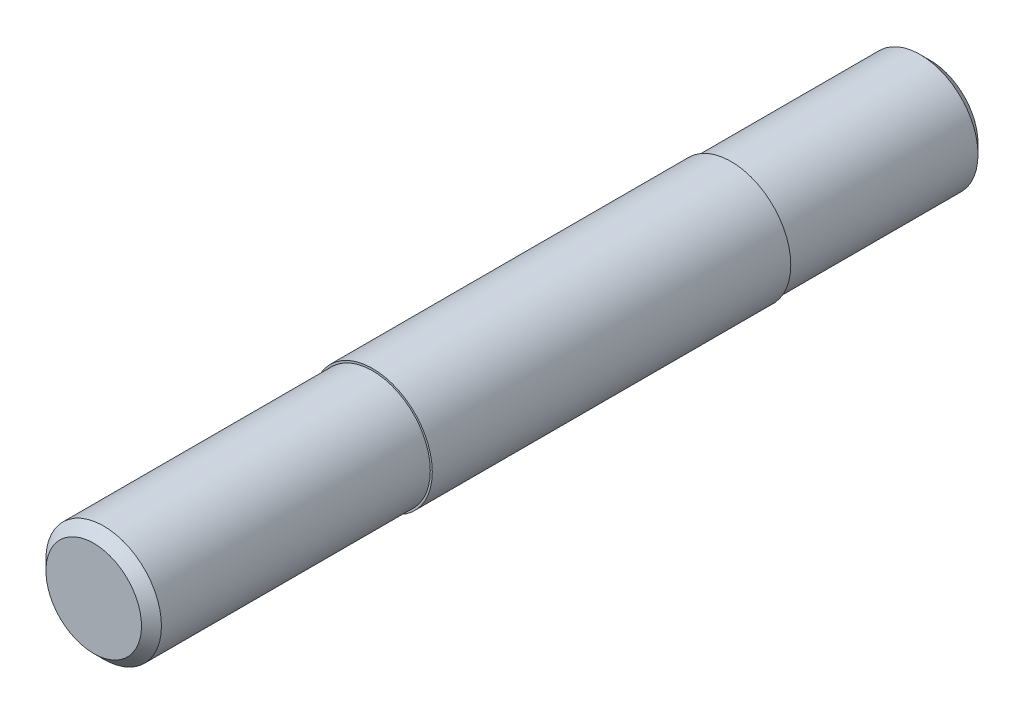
ISO-10303-21;
HEADER;
FILE_DESCRIPTION(('STEP AP214'),'2;1');
FILE_NAME('part.step','',(''),(''),'','','');
FILE_SCHEMA(('AUTOMOTIVE_DESIGN { 1 0 10303 214 1 1 1 1 }'));
ENDSEC;
DATA;
#1=APPLICATION_CONTEXT('core data for automotive mechanical design processes');
#2=APPLICATION_PROTOCOL_DEFINITION('international standard','automotive_design',2000,#1);
#3=PRODUCT_CONTEXT('',#1,'mechanical');
#4=PRODUCT('Part','Part','',(#3));
#5=PRODUCT_RELATED_PRODUCT_CATEGORY('part','',(#4));
#6=PRODUCT_DEFINITION_FORMATION('','',#4);
#7=PRODUCT_DEFINITION_CONTEXT('part definition',#1,'design');
#8=PRODUCT_DEFINITION('design','',#6,#7);
#9=PRODUCT_DEFINITION_SHAPE('','',#8);
#10=(LENGTH_UNIT() NAMED_UNIT(*) SI_UNIT(.MILLI.,.METRE.));
#11=(NAMED_UNIT(*) PLANE_ANGLE_UNIT() SI_UNIT($,.RADIAN.));
#12=(NAMED_UNIT(*) SI_UNIT($,.STERADIAN.) SOLID_ANGLE_UNIT());
#13=UNCERTAINTY_MEASURE_WITH_UNIT(LENGTH_MEASURE(1.E-05),#10,'distance_accuracy_value','');
#14=(GEOMETRIC_REPRESENTATION_CONTEXT(3) GLOBAL_UNCERTAINTY_ASSIGNED_CONTEXT((#13)) GLOBAL_UNIT_ASSIGNED_CONTEXT((#10,
#11,#12)) REPRESENTATION_CONTEXT('',''));
#15=CARTESIAN_POINT('',(0.,0.,0.));
#16=DIRECTION('',(0.,0.,1.));
#17=DIRECTION('',(1.,0.,0.));
#18=AXIS2_PLACEMENT_3D('',#15,#16,#17);
#19=CARTESIAN_POINT('',(0.,0.,28.));
#20=DIRECTION('',(0.,0.,1.));
#21=DIRECTION('',(1.,0.,0.));
#22=AXIS2_PLACEMENT_3D('',#19,#20,#21);
#23=PLANE('',#22);
#24=CARTESIAN_POINT('',(0.,0.,28.));
#25=DIRECTION('',(0.,0.,1.));
#26=DIRECTION('',(1.,0.,0.));
#27=AXIS2_PLACEMENT_3D('',#24,#25,#26);
#28=CIRCLE('',#27,3.);
#29=CARTESIAN_POINT('',(3.,0.,28.));
#30=VERTEX_POINT('',#29);
#31=EDGE_CURVE('E54',#30,#30,#28,.T.);
#32=ORIENTED_EDGE('',*,*,#31,.T.);
#33=EDGE_LOOP('',(#32));
#34=FACE_BOUND('',#33,.T.);
#35=CARTESIAN_POINT('',(0.,0.,28.));
#36=DIRECTION('',(0.,0.,1.));
#37=DIRECTION('',(1.,0.,0.));
#38=AXIS2_PLACEMENT_3D('',#35,#36,#37);
#39=CIRCLE('',#38,2.9);
#40=CARTESIAN_POINT('',(2.9,0.,28.));
#41=VERTEX_POINT('',#40);
#42=EDGE_CURVE('E60',#41,#41,#39,.T.);
#43=ORIENTED_EDGE('',*,*,#42,.F.);
#44=EDGE_LOOP('',(#43));
#45=FACE_BOUND('',#44,.T.);
#46=ADVANCED_FACE('F31',(#34,#45),#23,.T.);
#47=CARTESIAN_POINT('',(0.,0.,10.));
#48=DIRECTION('',(0.,0.,-1.));
#49=DIRECTION('',(-1.,0.,0.));
#50=AXIS2_PLACEMENT_3D('',#47,#48,#49);
#51=CYLINDRICAL_SURFACE('',#50,2.9);
#52=CARTESIAN_POINT('',(0.,0.,0.500000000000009));
#53=DIRECTION('',(0.,0.,1.));
#54=DIRECTION('',(1.,0.,0.));
#55=AXIS2_PLACEMENT_3D('',#52,#53,#54);
#56=CIRCLE('',#55,2.9);
#57=CARTESIAN_POINT('',(2.9,0.,0.500000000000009));
#58=VERTEX_POINT('',#57);
#59=EDGE_CURVE('E38',#58,#58,#56,.T.);
#60=ORIENTED_EDGE('',*,*,#59,.T.);
#61=EDGE_LOOP('',(#60));
#62=FACE_BOUND('',#61,.T.);
#63=CARTESIAN_POINT('',(0.,0.,10.));
#64=DIRECTION('',(0.,0.,1.));
#65=DIRECTION('',(1.,0.,0.));
#66=AXIS2_PLACEMENT_3D('',#63,#64,#65);
#67=CIRCLE('',#66,2.9);
#68=CARTESIAN_POINT('',(2.9,0.,10.));
#69=VERTEX_POINT('',#68);
#70=EDGE_CURVE('E51',#69,#69,#67,.T.);
#71=ORIENTED_EDGE('',*,*,#70,.F.);
#72=EDGE_LOOP('',(#71));
#73=FACE_BOUND('',#72,.T.);
#74=ADVANCED_FACE('F33',(#62,#73),#51,.T.);
#75=CARTESIAN_POINT('',(0.,0.,0.));
#76=DIRECTION('',(0.,0.,1.));
#77=DIRECTION('',(1.,0.,0.));
#78=AXIS2_PLACEMENT_3D('',#75,#76,#77);
#79=PLANE('',#78);
#80=CARTESIAN_POINT('',(0.,0.,0.));
#81=DIRECTION('',(0.,0.,1.));
#82=DIRECTION('',(1.,0.,0.));
#83=AXIS2_PLACEMENT_3D('',#80,#81,#82);
#84=CIRCLE('',#83,2.4);
#85=CARTESIAN_POINT('',(2.4,0.,0.));
#86=VERTEX_POINT('',#85);
#87=EDGE_CURVE('E10',#86,#86,#84,.F.);
#88=ORIENTED_EDGE('',*,*,#87,.T.);
#89=EDGE_LOOP('',(#88));
#90=FACE_BOUND('',#89,.T.);
#91=ADVANCED_FACE('F73',(#90),#79,.F.);
#92=CARTESIAN_POINT('',(0.,0.,10.));
#93=DIRECTION('',(0.,0.,1.));
#94=DIRECTION('',(1.,0.,0.));
#95=AXIS2_PLACEMENT_3D('',#92,#93,#94);
#96=PLANE('',#95);
#97=CARTESIAN_POINT('',(0.,0.,10.));
#98=DIRECTION('',(0.,0.,1.));
#99=DIRECTION('',(1.,0.,0.));
#100=AXIS2_PLACEMENT_3D('',#97,#98,#99);
#101=CIRCLE('',#100,3.);
#102=CARTESIAN_POINT('',(3.,0.,10.));
#103=VERTEX_POINT('',#102);
#104=EDGE_CURVE('E57',#103,#103,#101,.T.);
#105=ORIENTED_EDGE('',*,*,#104,.F.);
#106=EDGE_LOOP('',(#105));
#107=FACE_BOUND('',#106,.T.);
#108=ORIENTED_EDGE('',*,*,#70,.T.);
#109=EDGE_LOOP('',(#108));
#110=FACE_BOUND('',#109,.T.);
#111=ADVANCED_FACE('F76',(#107,#110),#96,.F.);
#112=CARTESIAN_POINT('',(0.,0.,28.));
#113=DIRECTION('',(0.,0.,-1.));
#114=DIRECTION('',(-1.,0.,0.));
#115=AXIS2_PLACEMENT_3D('',#112,#113,#114);
#116=CYLINDRICAL_SURFACE('',#115,3.);
#117=ORIENTED_EDGE('',*,*,#31,.F.);
#118=EDGE_LOOP('',(#117));
#119=FACE_BOUND('',#118,.T.);
#120=ORIENTED_EDGE('',*,*,#104,.T.);
#121=EDGE_LOOP('',(#120));
#122=FACE_BOUND('',#121,.T.);
#123=ADVANCED_FACE('F78',(#119,#122),#116,.T.);
#124=CARTESIAN_POINT('',(0.,0.,42.));
#125=DIRECTION('',(0.,0.,-1.));
#126=DIRECTION('',(-1.,0.,0.));
#127=AXIS2_PLACEMENT_3D('',#124,#125,#126);
#128=CYLINDRICAL_SURFACE('',#127,2.9);
#129=CARTESIAN_POINT('',(0.,0.,41.5));
#130=DIRECTION('',(0.,0.,1.));
#131=DIRECTION('',(1.,0.,0.));
#132=AXIS2_PLACEMENT_3D('',#129,#130,#131);
#133=CIRCLE('',#132,2.9);
#134=CARTESIAN_POINT('',(2.9,0.,41.5));
#135=VERTEX_POINT('',#134);
#136=EDGE_CURVE('E42',#135,#135,#133,.F.);
#137=ORIENTED_EDGE('',*,*,#136,.T.);
#138=EDGE_LOOP('',(#137));
#139=FACE_BOUND('',#138,.T.);
#140=ORIENTED_EDGE('',*,*,#42,.T.);
#141=EDGE_LOOP('',(#140));
#142=FACE_BOUND('',#141,.T.);
#143=ADVANCED_FACE('F64',(#139,#142),#128,.T.);
#144=CARTESIAN_POINT('',(0.,0.,42.));
#145=DIRECTION('',(0.,0.,1.));
#146=DIRECTION('',(1.,0.,0.));
#147=AXIS2_PLACEMENT_3D('',#144,#145,#146);
#148=PLANE('',#147);
#149=CARTESIAN_POINT('',(0.,0.,42.));
#150=DIRECTION('',(0.,0.,1.));
#151=DIRECTION('',(1.,0.,0.));
#152=AXIS2_PLACEMENT_3D('',#149,#150,#151);
#153=CIRCLE('',#152,2.39999999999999);
#154=CARTESIAN_POINT('',(2.39999999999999,0.,42.));
#155=VERTEX_POINT('',#154);
#156=EDGE_CURVE('E46',#155,#155,#153,.T.);
#157=ORIENTED_EDGE('',*,*,#156,.T.);
#158=EDGE_LOOP('',(#157));
#159=FACE_BOUND('',#158,.T.);
#160=ADVANCED_FACE('F97',(#159),#148,.T.);
#161=CARTESIAN_POINT('',(0.,0.,42.));
#162=DIRECTION('',(0.,0.,-1.));
#163=DIRECTION('',(-1.,0.,0.));
#164=AXIS2_PLACEMENT_3D('',#161,#162,#163);
#165=CONICAL_SURFACE('',#164,2.39999999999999,0.785398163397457);
#166=ORIENTED_EDGE('',*,*,#136,.F.);
#167=EDGE_LOOP('',(#166));
#168=FACE_BOUND('',#167,.T.);
#169=ORIENTED_EDGE('',*,*,#156,.F.);
#170=EDGE_LOOP('',(#169));
#171=FACE_BOUND('',#170,.T.);
#172=ADVANCED_FACE('F103',(#168,#171),#165,.T.);
#173=CARTESIAN_POINT('',(0.,0.,0.500000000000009));
#174=DIRECTION('',(0.,0.,1.));
#175=DIRECTION('',(1.,0.,0.));
#176=AXIS2_PLACEMENT_3D('',#173,#174,#175);
#177=CONICAL_SURFACE('',#176,2.9,0.785398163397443);
#178=ORIENTED_EDGE('',*,*,#87,.F.);
#179=EDGE_LOOP('',(#178));
#180=FACE_BOUND('',#179,.T.);
#181=ORIENTED_EDGE('',*,*,#59,.F.);
#182=EDGE_LOOP('',(#181));
#183=FACE_BOUND('',#182,.T.);
#184=ADVANCED_FACE('F109',(#180,#183),#177,.T.);
#185=CLOSED_SHELL('',(#46,#74,#91,#111,#123,#143,#160,#172,#184));
#186=MANIFOLD_SOLID_BREP('B2',#185);
#187=ADVANCED_BREP_SHAPE_REPRESENTATION('',(#18,#186),#14);
#188=SHAPE_DEFINITION_REPRESENTATION(#9,#187);
ENDSEC;
END-ISO-10303-21;
